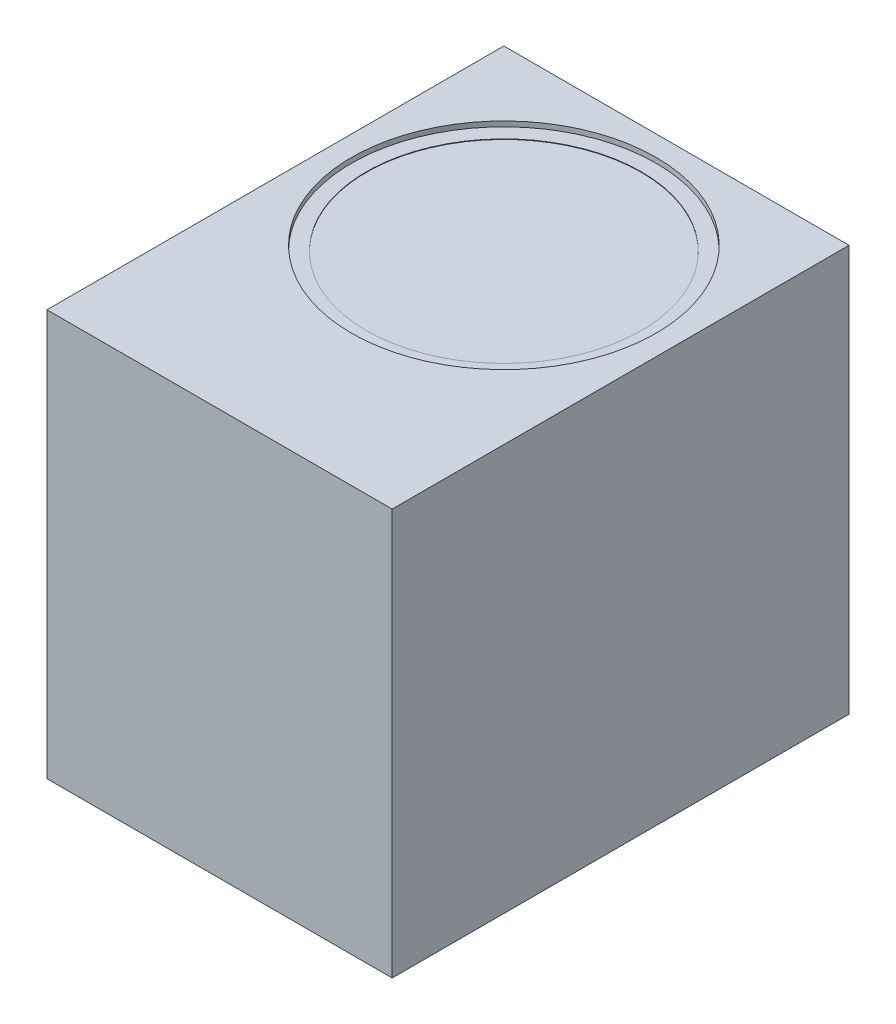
ISO-10303-21;
HEADER;
FILE_DESCRIPTION(('STEP AP214'),'2;1');
FILE_NAME('part.step','',(''),(''),'','','');
FILE_SCHEMA(('AUTOMOTIVE_DESIGN { 1 0 10303 214 1 1 1 1 }'));
ENDSEC;
DATA;
#1=APPLICATION_CONTEXT('core data for automotive mechanical design processes');
#2=APPLICATION_PROTOCOL_DEFINITION('international standard','automotive_design',2000,#1);
#3=PRODUCT_CONTEXT('',#1,'mechanical');
#4=PRODUCT('Part','Part','',(#3));
#5=PRODUCT_RELATED_PRODUCT_CATEGORY('part','',(#4));
#6=PRODUCT_DEFINITION_FORMATION('','',#4);
#7=PRODUCT_DEFINITION_CONTEXT('part definition',#1,'design');
#8=PRODUCT_DEFINITION('design','',#6,#7);
#9=PRODUCT_DEFINITION_SHAPE('','',#8);
#10=(LENGTH_UNIT() NAMED_UNIT(*) SI_UNIT(.MILLI.,.METRE.));
#11=(NAMED_UNIT(*) PLANE_ANGLE_UNIT() SI_UNIT($,.RADIAN.));
#12=(NAMED_UNIT(*) SI_UNIT($,.STERADIAN.) SOLID_ANGLE_UNIT());
#13=UNCERTAINTY_MEASURE_WITH_UNIT(LENGTH_MEASURE(1.E-05),#10,'distance_accuracy_value','');
#14=(GEOMETRIC_REPRESENTATION_CONTEXT(3) GLOBAL_UNCERTAINTY_ASSIGNED_CONTEXT((#13)) GLOBAL_UNIT_ASSIGNED_CONTEXT((#10,
#11,#12)) REPRESENTATION_CONTEXT('',''));
#15=CARTESIAN_POINT('',(0.,0.,0.));
#16=DIRECTION('',(0.,0.,1.));
#17=DIRECTION('',(1.,0.,0.));
#18=AXIS2_PLACEMENT_3D('',#15,#16,#17);
#19=CARTESIAN_POINT('',(-34.,80.,0.));
#20=DIRECTION('',(1.,0.,0.));
#21=DIRECTION('',(0.,0.,-1.));
#22=AXIS2_PLACEMENT_3D('',#19,#20,#21);
#23=PLANE('',#22);
#24=DIRECTION('',(0.,0.,1.));
#25=VECTOR('',#24,1.);
#26=CARTESIAN_POINT('',(-34.,0.,0.));
#27=LINE('',#26,#25);
#28=CARTESIAN_POINT('',(-34.,0.,-34.));
#29=VERTEX_POINT('',#28);
#30=CARTESIAN_POINT('',(-34.,0.,56.));
#31=VERTEX_POINT('',#30);
#32=EDGE_CURVE('E74',#29,#31,#27,.T.);
#33=ORIENTED_EDGE('',*,*,#32,.T.);
#34=DIRECTION('',(0.,-1.,0.));
#35=VECTOR('',#34,1.);
#36=CARTESIAN_POINT('',(-34.,80.,56.));
#37=LINE('',#36,#35);
#38=CARTESIAN_POINT('',(-34.,80.,56.));
#39=VERTEX_POINT('',#38);
#40=EDGE_CURVE('E11',#39,#31,#37,.T.);
#41=ORIENTED_EDGE('',*,*,#40,.F.);
#42=DIRECTION('',(0.,0.,1.));
#43=VECTOR('',#42,1.);
#44=CARTESIAN_POINT('',(-34.,80.,0.));
#45=LINE('',#44,#43);
#46=CARTESIAN_POINT('',(-34.,80.,-34.));
#47=VERTEX_POINT('',#46);
#48=EDGE_CURVE('E79',#47,#39,#45,.T.);
#49=ORIENTED_EDGE('',*,*,#48,.F.);
#50=DIRECTION('',(0.,-1.,0.));
#51=VECTOR('',#50,1.);
#52=CARTESIAN_POINT('',(-34.,80.,-34.));
#53=LINE('',#52,#51);
#54=EDGE_CURVE('E95',#47,#29,#53,.T.);
#55=ORIENTED_EDGE('',*,*,#54,.T.);
#56=EDGE_LOOP('',(#33,#41,#49,#55));
#57=FACE_BOUND('',#56,.T.);
#58=ADVANCED_FACE('F35',(#57),#23,.F.);
#59=CARTESIAN_POINT('',(-34.,80.,56.));
#60=DIRECTION('',(0.,0.,-1.));
#61=DIRECTION('',(-1.,0.,0.));
#62=AXIS2_PLACEMENT_3D('',#59,#60,#61);
#63=PLANE('',#62);
#64=DIRECTION('',(1.,0.,0.));
#65=VECTOR('',#64,1.);
#66=CARTESIAN_POINT('',(-34.,0.,56.));
#67=LINE('',#66,#65);
#68=CARTESIAN_POINT('',(34.,0.,56.));
#69=VERTEX_POINT('',#68);
#70=EDGE_CURVE('E91',#31,#69,#67,.T.);
#71=ORIENTED_EDGE('',*,*,#70,.T.);
#72=DIRECTION('',(0.,-1.,0.));
#73=VECTOR('',#72,1.);
#74=CARTESIAN_POINT('',(34.,80.,56.));
#75=LINE('',#74,#73);
#76=CARTESIAN_POINT('',(34.,80.,56.));
#77=VERTEX_POINT('',#76);
#78=EDGE_CURVE('E43',#77,#69,#75,.T.);
#79=ORIENTED_EDGE('',*,*,#78,.F.);
#80=DIRECTION('',(1.,0.,0.));
#81=VECTOR('',#80,1.);
#82=CARTESIAN_POINT('',(-34.,80.,56.));
#83=LINE('',#82,#81);
#84=EDGE_CURVE('E82',#39,#77,#83,.T.);
#85=ORIENTED_EDGE('',*,*,#84,.F.);
#86=ORIENTED_EDGE('',*,*,#40,.T.);
#87=EDGE_LOOP('',(#71,#79,#85,#86));
#88=FACE_BOUND('',#87,.T.);
#89=ADVANCED_FACE('F90',(#88),#63,.F.);
#90=CARTESIAN_POINT('',(34.,80.,-34.));
#91=DIRECTION('',(-1.,0.,0.));
#92=DIRECTION('',(0.,0.,1.));
#93=AXIS2_PLACEMENT_3D('',#90,#91,#92);
#94=PLANE('',#93);
#95=DIRECTION('',(0.,0.,-1.));
#96=VECTOR('',#95,1.);
#97=CARTESIAN_POINT('',(34.,0.,-34.));
#98=LINE('',#97,#96);
#99=CARTESIAN_POINT('',(34.,0.,-34.));
#100=VERTEX_POINT('',#99);
#101=EDGE_CURVE('E67',#69,#100,#98,.T.);
#102=ORIENTED_EDGE('',*,*,#101,.T.);
#103=DIRECTION('',(0.,-1.,0.));
#104=VECTOR('',#103,1.);
#105=CARTESIAN_POINT('',(34.,80.,-34.));
#106=LINE('',#105,#104);
#107=CARTESIAN_POINT('',(34.,80.,-34.));
#108=VERTEX_POINT('',#107);
#109=EDGE_CURVE('E92',#108,#100,#106,.T.);
#110=ORIENTED_EDGE('',*,*,#109,.F.);
#111=DIRECTION('',(0.,0.,-1.));
#112=VECTOR('',#111,1.);
#113=CARTESIAN_POINT('',(34.,80.,56.));
#114=LINE('',#113,#112);
#115=EDGE_CURVE('E86',#77,#108,#114,.T.);
#116=ORIENTED_EDGE('',*,*,#115,.F.);
#117=ORIENTED_EDGE('',*,*,#78,.T.);
#118=EDGE_LOOP('',(#102,#110,#116,#117));
#119=FACE_BOUND('',#118,.T.);
#120=ADVANCED_FACE('F93',(#119),#94,.F.);
#121=CARTESIAN_POINT('',(-34.,80.,-34.));
#122=DIRECTION('',(0.,0.,1.));
#123=DIRECTION('',(1.,0.,0.));
#124=AXIS2_PLACEMENT_3D('',#121,#122,#123);
#125=PLANE('',#124);
#126=DIRECTION('',(-1.,0.,0.));
#127=VECTOR('',#126,1.);
#128=CARTESIAN_POINT('',(-34.,0.,-34.));
#129=LINE('',#128,#127);
#130=EDGE_CURVE('E103',#100,#29,#129,.T.);
#131=ORIENTED_EDGE('',*,*,#130,.T.);
#132=ORIENTED_EDGE('',*,*,#54,.F.);
#133=DIRECTION('',(-1.,0.,0.));
#134=VECTOR('',#133,1.);
#135=CARTESIAN_POINT('',(-34.,80.,-34.));
#136=LINE('',#135,#134);
#137=EDGE_CURVE('E51',#108,#47,#136,.T.);
#138=ORIENTED_EDGE('',*,*,#137,.F.);
#139=ORIENTED_EDGE('',*,*,#109,.T.);
#140=EDGE_LOOP('',(#131,#132,#138,#139));
#141=FACE_BOUND('',#140,.T.);
#142=ADVANCED_FACE('F108',(#141),#125,.F.);
#143=CARTESIAN_POINT('',(0.,80.,0.));
#144=DIRECTION('',(0.,-1.,0.));
#145=DIRECTION('',(0.,0.,-1.));
#146=AXIS2_PLACEMENT_3D('',#143,#144,#145);
#147=PLANE('',#146);
#148=CARTESIAN_POINT('',(0.,80.,0.));
#149=DIRECTION('',(0.,1.,0.));
#150=DIRECTION('',(0.,0.,1.));
#151=AXIS2_PLACEMENT_3D('',#148,#149,#150);
#152=CIRCLE('',#151,30.);
#153=CARTESIAN_POINT('',(0.,80.,30.));
#154=VERTEX_POINT('',#153);
#155=EDGE_CURVE('E129',#154,#154,#152,.T.);
#156=ORIENTED_EDGE('',*,*,#155,.F.);
#157=EDGE_LOOP('',(#156));
#158=FACE_BOUND('',#157,.T.);
#159=ORIENTED_EDGE('',*,*,#48,.T.);
#160=ORIENTED_EDGE('',*,*,#84,.T.);
#161=ORIENTED_EDGE('',*,*,#115,.T.);
#162=ORIENTED_EDGE('',*,*,#137,.T.);
#163=EDGE_LOOP('',(#159,#160,#161,#162));
#164=FACE_BOUND('',#163,.T.);
#165=ADVANCED_FACE('F84',(#158,#164),#147,.F.);
#166=CARTESIAN_POINT('',(0.,0.,0.));
#167=DIRECTION('',(0.,-1.,0.));
#168=DIRECTION('',(0.,0.,-1.));
#169=AXIS2_PLACEMENT_3D('',#166,#167,#168);
#170=PLANE('',#169);
#171=ORIENTED_EDGE('',*,*,#32,.F.);
#172=ORIENTED_EDGE('',*,*,#130,.F.);
#173=ORIENTED_EDGE('',*,*,#101,.F.);
#174=ORIENTED_EDGE('',*,*,#70,.F.);
#175=EDGE_LOOP('',(#171,#172,#173,#174));
#176=FACE_BOUND('',#175,.T.);
#177=ADVANCED_FACE('F109',(#176),#170,.T.);
#178=CARTESIAN_POINT('',(0.,79.,0.));
#179=DIRECTION('',(0.,1.,0.));
#180=DIRECTION('',(0.,0.,1.));
#181=AXIS2_PLACEMENT_3D('',#178,#179,#180);
#182=CYLINDRICAL_SURFACE('',#181,30.);
#183=CARTESIAN_POINT('',(0.,79.,0.));
#184=DIRECTION('',(0.,1.,0.));
#185=DIRECTION('',(0.,0.,1.));
#186=AXIS2_PLACEMENT_3D('',#183,#184,#185);
#187=CIRCLE('',#186,30.);
#188=CARTESIAN_POINT('',(0.,79.,30.));
#189=VERTEX_POINT('',#188);
#190=EDGE_CURVE('E100',#189,#189,#187,.T.);
#191=ORIENTED_EDGE('',*,*,#190,.F.);
#192=EDGE_LOOP('',(#191));
#193=FACE_BOUND('',#192,.T.);
#194=ORIENTED_EDGE('',*,*,#155,.T.);
#195=EDGE_LOOP('',(#194));
#196=FACE_BOUND('',#195,.T.);
#197=ADVANCED_FACE('F111',(#193,#196),#182,.F.);
#198=CARTESIAN_POINT('',(0.,79.,0.));
#199=DIRECTION('',(0.,1.,0.));
#200=DIRECTION('',(0.,0.,1.));
#201=AXIS2_PLACEMENT_3D('',#198,#199,#200);
#202=PLANE('',#201);
#203=CARTESIAN_POINT('',(0.,79.,0.));
#204=DIRECTION('',(0.,1.,0.));
#205=DIRECTION('',(0.,0.,1.));
#206=AXIS2_PLACEMENT_3D('',#203,#204,#205);
#207=CIRCLE('',#206,27.0916851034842);
#208=CARTESIAN_POINT('',(0.,79.,27.0916851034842));
#209=VERTEX_POINT('',#208);
#210=EDGE_CURVE('E135',#209,#209,#207,.T.);
#211=ORIENTED_EDGE('',*,*,#210,.F.);
#212=EDGE_LOOP('',(#211));
#213=FACE_BOUND('',#212,.T.);
#214=ORIENTED_EDGE('',*,*,#190,.T.);
#215=EDGE_LOOP('',(#214));
#216=FACE_BOUND('',#215,.T.);
#217=ADVANCED_FACE('F117',(#213,#216),#202,.T.);
#218=CARTESIAN_POINT('',(0.,78.9,0.));
#219=DIRECTION('',(0.,1.,0.));
#220=DIRECTION('',(0.,0.,1.));
#221=AXIS2_PLACEMENT_3D('',#218,#219,#220);
#222=CYLINDRICAL_SURFACE('',#221,27.0916851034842);
#223=CARTESIAN_POINT('',(0.,78.9,0.));
#224=DIRECTION('',(0.,1.,0.));
#225=DIRECTION('',(0.,0.,1.));
#226=AXIS2_PLACEMENT_3D('',#223,#224,#225);
#227=CIRCLE('',#226,27.0916851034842);
#228=CARTESIAN_POINT('',(0.,78.9,27.0916851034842));
#229=VERTEX_POINT('',#228);
#230=EDGE_CURVE('E132',#229,#229,#227,.T.);
#231=ORIENTED_EDGE('',*,*,#230,.F.);
#232=EDGE_LOOP('',(#231));
#233=FACE_BOUND('',#232,.T.);
#234=ORIENTED_EDGE('',*,*,#210,.T.);
#235=EDGE_LOOP('',(#234));
#236=FACE_BOUND('',#235,.T.);
#237=ADVANCED_FACE('F143',(#233,#236),#222,.F.);
#238=CARTESIAN_POINT('',(0.,78.9,0.));
#239=DIRECTION('',(0.,1.,0.));
#240=DIRECTION('',(0.,0.,1.));
#241=AXIS2_PLACEMENT_3D('',#238,#239,#240);
#242=PLANE('',#241);
#243=ORIENTED_EDGE('',*,*,#230,.T.);
#244=EDGE_LOOP('',(#243));
#245=FACE_BOUND('',#244,.T.);
#246=ADVANCED_FACE('F141',(#245),#242,.T.);
#247=CLOSED_SHELL('',(#58,#89,#120,#142,#165,#177,#197,#217,#237,#246));
#248=MANIFOLD_SOLID_BREP('B2',#247);
#249=ADVANCED_BREP_SHAPE_REPRESENTATION('',(#18,#248),#14);
#250=SHAPE_DEFINITION_REPRESENTATION(#9,#249);
ENDSEC;
END-ISO-10303-21;
